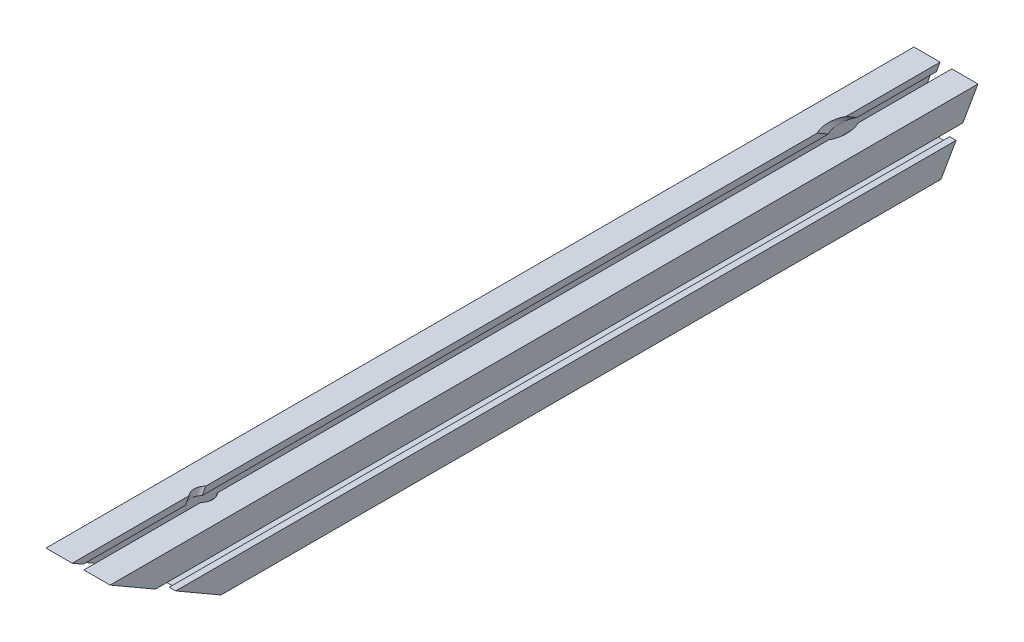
from build123d import *

# Parameters (mm, degrees)
BOSS_EXTRUDE1_DEPTH = 304.8
CUT_EXTRUDE1_DEPTH  = 609.6
SKETCH3_R           = 4.25
CUT_EXTRUDE2_DEPTH  = 609.6
SKETCH4_R           = 6.5
CUT_EXTRUDE3_DEPTH  = 609.6
SKETCH5_R           = 4.249999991
CUT_EXTRUDE4_DEPTH  = 609.6
SKETCH6_R           = 6.5
CUT_EXTRUDE5_DEPTH  = 609.6


with BuildPart() as part:
    # Sketch1 → Boss-Extrude1 (new, symmetric)
    with BuildSketch(Plane.XY):
        Polygon((-17.999999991, -6.799999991), (-17.999999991, -4.099999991), (-22.499999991, -4.099999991), (-22.499999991, -22.499999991), (-4.099999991, -22.499999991), (-4.099999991, -17.999999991), (-6.799999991, -17.999999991), (-6.799999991, -9.499999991), (-4.499999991, -7.199999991), (4.500000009, -7.199999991), (6.800000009, -9.499999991), (6.800000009, -17.999999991), (4.100000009, -17.999999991), (4.100000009, -22.499999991), (22.500000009, -22.499999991), (22.500000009, -4.099999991), (18.000000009, -4.099999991), (18.000000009, -6.799999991), (9.500000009, -6.799999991), (7.200000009, -4.499999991), (7.200000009, 4.500000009), (9.500000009, 6.800000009), (18.000000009, 6.800000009), (18.000000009, 4.100000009), (22.500000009, 4.100000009), (22.500000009, 22.500000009), (4.100000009, 22.500000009), (4.100000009, 18.000000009), (6.800000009, 18.000000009), (6.800000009, 9.500000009), (4.500000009, 7.200000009), (-4.499999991, 7.200000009), (-6.799999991, 9.500000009), (-6.799999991, 18.000000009), (-4.099999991, 18.000000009), (-4.099999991, 22.500000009), (-22.499999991, 22.500000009), (-22.499999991, 4.100000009), (-17.999999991, 4.100000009), (-17.999999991, 6.800000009), (-9.499999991, 6.800000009), (-7.199999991, 4.500000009), (-7.199999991, -4.499999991), (-9.499999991, -6.799999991), align=None)
        with BuildLine():
            Line((-20.499999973, 8.799995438), (-20.499999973, 15.500000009))
            ThreePointArc((-20.499999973, 15.500000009), (-19.035533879, 19.035533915), (-15.499999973, 20.500000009))
            Line((-15.499999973, 20.500000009), (-8.799995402, 20.500000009))
            Line((-8.799995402, 20.500000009), (-8.799995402, 13.799995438))
            ThreePointArc((-8.799995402, 13.799995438), (-10.264461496, 10.264461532), (-13.799995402, 8.799995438))
            Line((-13.799995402, 8.799995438), (-20.499999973, 8.799995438))
        make_face(mode=Mode.SUBTRACT)
        with BuildLine():
            Line((20.500000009, 8.79999542), (13.799995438, 8.79999542))
            ThreePointArc((13.799995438, 8.79999542), (10.264461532, 10.264461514), (8.799995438, 13.79999542))
            Line((8.799995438, 13.79999542), (8.799995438, 20.499999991))
            Line((8.799995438, 20.499999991), (15.500000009, 20.499999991))
            ThreePointArc((15.500000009, 20.499999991), (19.035533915, 19.035533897), (20.500000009, 15.499999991))
            Line((20.500000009, 15.499999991), (20.500000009, 8.79999542))
        make_face(mode=Mode.SUBTRACT)
        with BuildLine():
            Line((15.499999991, -20.499999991), (8.79999542, -20.499999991))
            Line((8.79999542, -20.499999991), (8.79999542, -13.79999542))
            ThreePointArc((8.79999542, -13.79999542), (10.264461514, -10.264461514), (13.79999542, -8.79999542))
            Line((13.79999542, -8.79999542), (20.499999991, -8.79999542))
            Line((20.499999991, -8.79999542), (20.499999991, -15.499999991))
            ThreePointArc((20.499999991, -15.499999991), (19.035533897, -19.035533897), (15.499999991, -20.499999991))
        make_face(mode=Mode.SUBTRACT)
        with BuildLine():
            Line((-8.79999542, -20.499999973), (-15.499999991, -20.499999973))
            ThreePointArc((-15.499999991, -20.499999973), (-19.035533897, -19.035533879), (-20.499999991, -15.499999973))
            Line((-20.499999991, -15.499999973), (-20.499999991, -8.799995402))
            Line((-20.499999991, -8.799995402), (-13.79999542, -8.799995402))
            ThreePointArc((-13.79999542, -8.799995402), (-10.264461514, -10.264461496), (-8.79999542, -13.799995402))
            Line((-8.79999542, -13.799995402), (-8.79999542, -20.499999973))
        make_face(mode=Mode.SUBTRACT)
        with BuildLine():
            Line((-3.262737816, 1.848524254), (-4.596194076, 3.181980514))
            Line((-4.596194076, 3.181980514), (-3.181980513, 4.596194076))
            Line((-3.181980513, 4.596194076), (-1.848524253, 3.262737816))
            ThreePointArc((-1.848524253, 3.262737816), (2e-09, 3.749999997), (1.848524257, 3.262737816))
            Line((1.848524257, 3.262737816), (3.181980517, 4.596194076))
            Line((3.181980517, 4.596194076), (4.59619408, 3.181980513))
            Line((4.59619408, 3.181980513), (3.26273782, 1.848524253))
            ThreePointArc((3.26273782, 1.848524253), (3.75, -2e-09), (3.262737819, -1.848524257))
            Line((3.262737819, -1.848524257), (4.596194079, -3.181980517))
            Line((4.596194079, -3.181980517), (3.181980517, -4.596194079))
            Line((3.181980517, -4.596194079), (1.848524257, -3.262737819))
            ThreePointArc((1.848524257, -3.262737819), (2e-09, -3.75), (-1.848524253, -3.262737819))
            Line((-1.848524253, -3.262737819), (-3.181980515, -4.596194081))
            Line((-3.181980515, -4.596194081), (-4.596194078, -3.181980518))
            Line((-4.596194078, -3.181980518), (-3.262737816, -1.848524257))
            ThreePointArc((-3.262737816, -1.848524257), (-3.749999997, -2e-09), (-3.262737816, 1.848524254))
        make_face(mode=Mode.SUBTRACT)
    extrude(amount=BOSS_EXTRUDE1_DEPTH, both=True)

    # Sketch2 → Cut-Extrude1 (cut)
    with BuildSketch(Plane(origin=(22.500000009, 0, 0), x_dir=(0, 0, -1), z_dir=(1, 0, 0))):
        Polygon((-304.8, 22.500000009), (-226.857713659, -22.499999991), (-304.8, -22.499999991), align=None)
        Polygon((304.8, 22.500000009), (278.819237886, -22.499999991), (304.8, -22.499999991), align=None)
    extrude(amount=-CUT_EXTRUDE1_DEPTH, mode=Mode.SUBTRACT)

    # Sketch3 → Cut-Extrude2 (cut)
    with BuildSketch(Plane(origin=(0, -126.357271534, -218.857214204), x_dir=(-1, 0, 0), z_dir=(0, -0.499999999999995, -0.8660254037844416))):
        with Locations(Location((-9e-09, 133.785571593, 0), (0, 0, 115.78191394))):
            Circle(SKETCH3_R)
    extrude(amount=-CUT_EXTRUDE2_DEPTH, mode=Mode.SUBTRACT)

    # Sketch4 → Cut-Extrude3 (cut)
    with BuildSketch(Plane(origin=(0, -115.562271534, -200.159725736), x_dir=(-1, 0, 0), z_dir=(0, -0.49999999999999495, -0.8660254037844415))):
        with Locations(Location((-9e-09, 133.785571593, 0), (0, 0, 90))):
            Circle(SKETCH4_R)
    extrude(amount=-CUT_EXTRUDE3_DEPTH, mode=Mode.SUBTRACT)

    # Sketch5 → Cut-Extrude4 (cut)
    with BuildSketch(Plane(origin=(0, -115.10727153, 66.457214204), x_dir=(1, 0, 0), z_dir=(0, -0.8660254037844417, 0.4999999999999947))):
        with Locations(Location((9e-09, 199.014543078, 0), (0, 0, 295.781913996))):
            Circle(SKETCH5_R)
    extrude(amount=-CUT_EXTRUDE4_DEPTH, mode=Mode.SUBTRACT)

    # Sketch6 → Cut-Extrude5 (cut)
    with BuildSketch(Plane(origin=(0, -96.409783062, 55.662214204), x_dir=(-1, 0, 0), z_dir=(0, -0.8660254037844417, 0.4999999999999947))):
        with Locations(Location((-9e-09, -199.014543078, 0), (0, 0, 106.522290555))):
            Circle(SKETCH6_R)
    extrude(amount=-CUT_EXTRUDE5_DEPTH, mode=Mode.SUBTRACT)


solid = part.part
